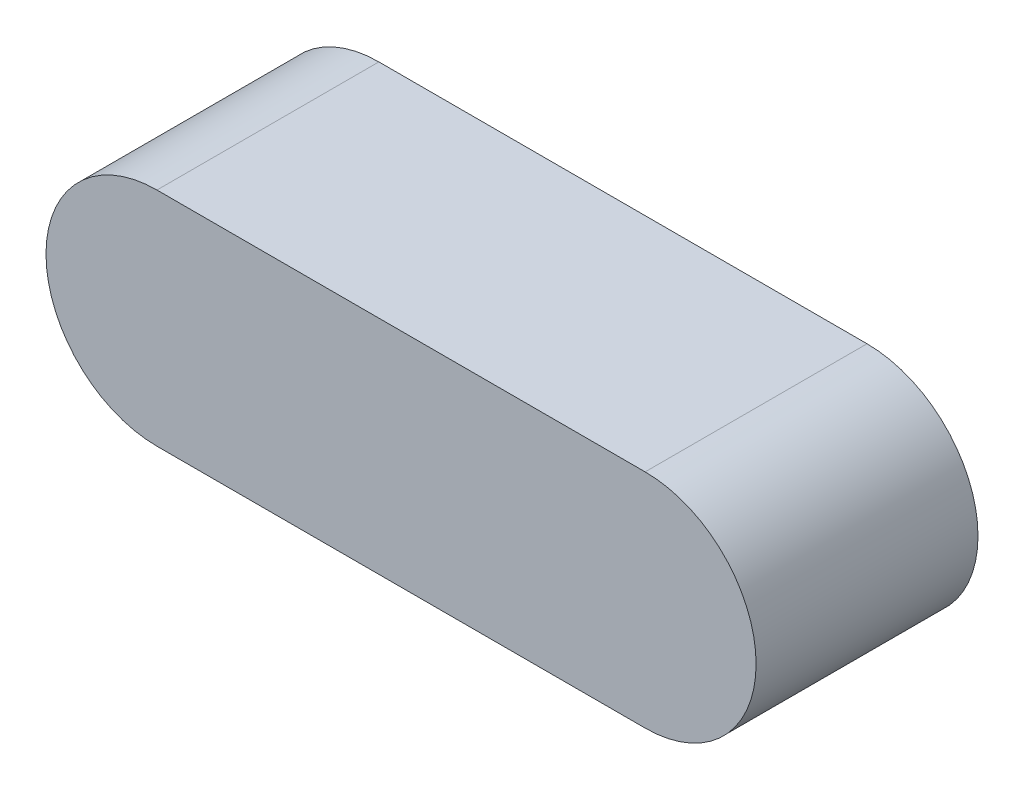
ISO-10303-21;
HEADER;
FILE_DESCRIPTION(('STEP AP214'),'2;1');
FILE_NAME('part.step','',(''),(''),'','','');
FILE_SCHEMA(('AUTOMOTIVE_DESIGN { 1 0 10303 214 1 1 1 1 }'));
ENDSEC;
DATA;
#1=APPLICATION_CONTEXT('core data for automotive mechanical design processes');
#2=APPLICATION_PROTOCOL_DEFINITION('international standard','automotive_design',2000,#1);
#3=PRODUCT_CONTEXT('',#1,'mechanical');
#4=PRODUCT('Part','Part','',(#3));
#5=PRODUCT_RELATED_PRODUCT_CATEGORY('part','',(#4));
#6=PRODUCT_DEFINITION_FORMATION('','',#4);
#7=PRODUCT_DEFINITION_CONTEXT('part definition',#1,'design');
#8=PRODUCT_DEFINITION('design','',#6,#7);
#9=PRODUCT_DEFINITION_SHAPE('','',#8);
#10=(LENGTH_UNIT() NAMED_UNIT(*) SI_UNIT(.MILLI.,.METRE.));
#11=(NAMED_UNIT(*) PLANE_ANGLE_UNIT() SI_UNIT($,.RADIAN.));
#12=(NAMED_UNIT(*) SI_UNIT($,.STERADIAN.) SOLID_ANGLE_UNIT());
#13=UNCERTAINTY_MEASURE_WITH_UNIT(LENGTH_MEASURE(1.E-05),#10,'distance_accuracy_value','');
#14=(GEOMETRIC_REPRESENTATION_CONTEXT(3) GLOBAL_UNCERTAINTY_ASSIGNED_CONTEXT((#13)) GLOBAL_UNIT_ASSIGNED_CONTEXT((#10,
#11,#12)) REPRESENTATION_CONTEXT('',''));
#15=CARTESIAN_POINT('',(0.,0.,0.));
#16=DIRECTION('',(0.,0.,1.));
#17=DIRECTION('',(1.,0.,0.));
#18=AXIS2_PLACEMENT_3D('',#15,#16,#17);
#19=CARTESIAN_POINT('',(0.,0.,0.));
#20=DIRECTION('',(0.,0.,1.));
#21=DIRECTION('',(1.,0.,0.));
#22=AXIS2_PLACEMENT_3D('',#19,#20,#21);
#23=PLANE('',#22);
#24=DIRECTION('',(1.,0.,0.));
#25=VECTOR('',#24,1.);
#26=CARTESIAN_POINT('',(-5.5,2.5,0.));
#27=LINE('',#26,#25);
#28=CARTESIAN_POINT('',(5.5,2.5,0.));
#29=VERTEX_POINT('',#28);
#30=CARTESIAN_POINT('',(-5.5,2.5,0.));
#31=VERTEX_POINT('',#30);
#32=EDGE_CURVE('E53',#29,#31,#27,.F.);
#33=ORIENTED_EDGE('',*,*,#32,.F.);
#34=CARTESIAN_POINT('',(5.5,0.,0.));
#35=DIRECTION('',(0.,0.,1.));
#36=DIRECTION('',(1.,0.,0.));
#37=AXIS2_PLACEMENT_3D('',#34,#35,#36);
#38=CIRCLE('',#37,2.5);
#39=CARTESIAN_POINT('',(5.5,-2.5,0.));
#40=VERTEX_POINT('',#39);
#41=EDGE_CURVE('E68',#40,#29,#38,.T.);
#42=ORIENTED_EDGE('',*,*,#41,.F.);
#43=DIRECTION('',(1.,0.,0.));
#44=VECTOR('',#43,1.);
#45=CARTESIAN_POINT('',(5.5,-2.5,0.));
#46=LINE('',#45,#44);
#47=CARTESIAN_POINT('',(-5.5,-2.5,0.));
#48=VERTEX_POINT('',#47);
#49=EDGE_CURVE('E66',#48,#40,#46,.T.);
#50=ORIENTED_EDGE('',*,*,#49,.F.);
#51=CARTESIAN_POINT('',(-5.5,0.,0.));
#52=DIRECTION('',(0.,0.,1.));
#53=DIRECTION('',(1.,0.,0.));
#54=AXIS2_PLACEMENT_3D('',#51,#52,#53);
#55=CIRCLE('',#54,2.5);
#56=EDGE_CURVE('E19',#31,#48,#55,.T.);
#57=ORIENTED_EDGE('',*,*,#56,.F.);
#58=EDGE_LOOP('',(#33,#42,#50,#57));
#59=FACE_BOUND('',#58,.T.);
#60=ADVANCED_FACE('F16',(#59),#23,.F.);
#61=CARTESIAN_POINT('',(-5.5,2.5,0.));
#62=DIRECTION('',(0.,1.,0.));
#63=DIRECTION('',(0.,0.,1.));
#64=AXIS2_PLACEMENT_3D('',#61,#62,#63);
#65=PLANE('',#64);
#66=ORIENTED_EDGE('',*,*,#32,.T.);
#67=DIRECTION('',(0.,0.,1.));
#68=VECTOR('',#67,1.);
#69=CARTESIAN_POINT('',(-5.5,2.5,0.));
#70=LINE('',#69,#68);
#71=CARTESIAN_POINT('',(-5.5,2.5,5.));
#72=VERTEX_POINT('',#71);
#73=EDGE_CURVE('E63',#72,#31,#70,.F.);
#74=ORIENTED_EDGE('',*,*,#73,.F.);
#75=DIRECTION('',(1.,0.,0.));
#76=VECTOR('',#75,1.);
#77=CARTESIAN_POINT('',(0.,2.5,5.));
#78=LINE('',#77,#76);
#79=CARTESIAN_POINT('',(5.5,2.5,5.));
#80=VERTEX_POINT('',#79);
#81=EDGE_CURVE('E80',#80,#72,#78,.F.);
#82=ORIENTED_EDGE('',*,*,#81,.F.);
#83=DIRECTION('',(0.,0.,1.));
#84=VECTOR('',#83,1.);
#85=CARTESIAN_POINT('',(5.5,2.5,0.));
#86=LINE('',#85,#84);
#87=EDGE_CURVE('E81',#29,#80,#86,.T.);
#88=ORIENTED_EDGE('',*,*,#87,.F.);
#89=EDGE_LOOP('',(#66,#74,#82,#88));
#90=FACE_BOUND('',#89,.T.);
#91=ADVANCED_FACE('F90',(#90),#65,.T.);
#92=CARTESIAN_POINT('',(-5.5,0.,0.));
#93=DIRECTION('',(0.,0.,1.));
#94=DIRECTION('',(1.,0.,0.));
#95=AXIS2_PLACEMENT_3D('',#92,#93,#94);
#96=CYLINDRICAL_SURFACE('',#95,2.5);
#97=ORIENTED_EDGE('',*,*,#56,.T.);
#98=DIRECTION('',(0.,0.,-1.));
#99=VECTOR('',#98,1.);
#100=CARTESIAN_POINT('',(-5.5,-2.5,0.));
#101=LINE('',#100,#99);
#102=CARTESIAN_POINT('',(-5.5,-2.5,5.));
#103=VERTEX_POINT('',#102);
#104=EDGE_CURVE('E62',#103,#48,#101,.T.);
#105=ORIENTED_EDGE('',*,*,#104,.F.);
#106=CARTESIAN_POINT('',(-5.5,0.,5.));
#107=DIRECTION('',(0.,0.,1.));
#108=DIRECTION('',(1.,0.,0.));
#109=AXIS2_PLACEMENT_3D('',#106,#107,#108);
#110=CIRCLE('',#109,2.5);
#111=EDGE_CURVE('E79',#72,#103,#110,.T.);
#112=ORIENTED_EDGE('',*,*,#111,.F.);
#113=ORIENTED_EDGE('',*,*,#73,.T.);
#114=EDGE_LOOP('',(#97,#105,#112,#113));
#115=FACE_BOUND('',#114,.T.);
#116=ADVANCED_FACE('F59',(#115),#96,.T.);
#117=CARTESIAN_POINT('',(5.5,-2.5,0.));
#118=DIRECTION('',(0.,-1.,0.));
#119=DIRECTION('',(0.,0.,-1.));
#120=AXIS2_PLACEMENT_3D('',#117,#118,#119);
#121=PLANE('',#120);
#122=ORIENTED_EDGE('',*,*,#49,.T.);
#123=DIRECTION('',(0.,0.,1.));
#124=VECTOR('',#123,1.);
#125=CARTESIAN_POINT('',(5.5,-2.5,0.));
#126=LINE('',#125,#124);
#127=CARTESIAN_POINT('',(5.5,-2.5,5.));
#128=VERTEX_POINT('',#127);
#129=EDGE_CURVE('E34',#128,#40,#126,.F.);
#130=ORIENTED_EDGE('',*,*,#129,.F.);
#131=DIRECTION('',(1.,0.,0.));
#132=VECTOR('',#131,1.);
#133=CARTESIAN_POINT('',(0.,-2.5,5.));
#134=LINE('',#133,#132);
#135=EDGE_CURVE('E25',#103,#128,#134,.T.);
#136=ORIENTED_EDGE('',*,*,#135,.F.);
#137=ORIENTED_EDGE('',*,*,#104,.T.);
#138=EDGE_LOOP('',(#122,#130,#136,#137));
#139=FACE_BOUND('',#138,.T.);
#140=ADVANCED_FACE('F70',(#139),#121,.T.);
#141=CARTESIAN_POINT('',(5.5,0.,0.));
#142=DIRECTION('',(0.,0.,1.));
#143=DIRECTION('',(1.,0.,0.));
#144=AXIS2_PLACEMENT_3D('',#141,#142,#143);
#145=CYLINDRICAL_SURFACE('',#144,2.5);
#146=ORIENTED_EDGE('',*,*,#41,.T.);
#147=ORIENTED_EDGE('',*,*,#87,.T.);
#148=CARTESIAN_POINT('',(5.5,0.,5.));
#149=DIRECTION('',(0.,0.,1.));
#150=DIRECTION('',(1.,0.,0.));
#151=AXIS2_PLACEMENT_3D('',#148,#149,#150);
#152=CIRCLE('',#151,2.5);
#153=EDGE_CURVE('E11',#128,#80,#152,.T.);
#154=ORIENTED_EDGE('',*,*,#153,.F.);
#155=ORIENTED_EDGE('',*,*,#129,.T.);
#156=EDGE_LOOP('',(#146,#147,#154,#155));
#157=FACE_BOUND('',#156,.T.);
#158=ADVANCED_FACE('F84',(#157),#145,.T.);
#159=CARTESIAN_POINT('',(0.,0.,5.));
#160=DIRECTION('',(0.,0.,1.));
#161=DIRECTION('',(1.,0.,0.));
#162=AXIS2_PLACEMENT_3D('',#159,#160,#161);
#163=PLANE('',#162);
#164=ORIENTED_EDGE('',*,*,#135,.T.);
#165=ORIENTED_EDGE('',*,*,#153,.T.);
#166=ORIENTED_EDGE('',*,*,#81,.T.);
#167=ORIENTED_EDGE('',*,*,#111,.T.);
#168=EDGE_LOOP('',(#164,#165,#166,#167));
#169=FACE_BOUND('',#168,.T.);
#170=ADVANCED_FACE('F87',(#169),#163,.T.);
#171=CLOSED_SHELL('',(#60,#91,#116,#140,#158,#170));
#172=MANIFOLD_SOLID_BREP('B1',#171);
#173=ADVANCED_BREP_SHAPE_REPRESENTATION('',(#18,#172),#14);
#174=SHAPE_DEFINITION_REPRESENTATION(#9,#173);
ENDSEC;
END-ISO-10303-21;
